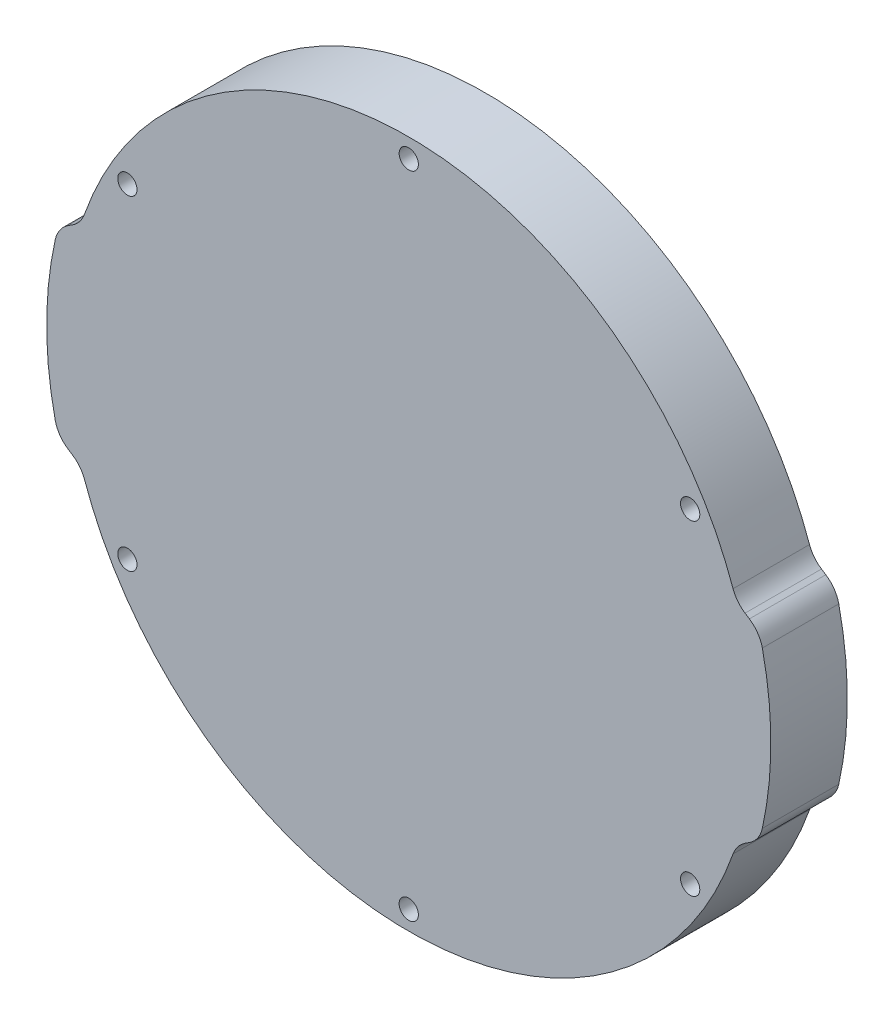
from build123d import *

# Parameters (mm, degrees)
SKETCH1_R           = 1.6
BOSS_EXTRUDE1_DEPTH = 12.7
FILLET1_R           = 5


with BuildPart() as part:
    # Sketch1 → Boss-Extrude1 (new body)
    with BuildSketch(Plane.XY):
        with BuildLine():
            Line((-58.249656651, 15), (-54.404710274, 17.5))
            ThreePointArc((-54.404710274, 17.5), (0, 57.15), (54.404710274, 17.5))
            Line((54.404710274, 17.5), (58.249656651, 15))
            ThreePointArc((58.249656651, 15), (60.15, 0), (58.249656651, -15))
            Line((58.249656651, -15), (54.404710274, -17.5))
            ThreePointArc((54.404710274, -17.5), (0, -57.15), (-54.404710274, -17.5))
            Line((-54.404710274, -17.5), (-58.249656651, -15))
            ThreePointArc((-58.249656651, -15), (-60.15, 0), (-58.249656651, 15))
        make_face()
        with Locations((0, 53.975)):
            Circle(SKETCH1_R, mode=Mode.SUBTRACT)
        with Locations((46.743721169, 26.9875)):
            Circle(SKETCH1_R, mode=Mode.SUBTRACT)
        with Locations((46.743721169, -26.9875)):
            Circle(SKETCH1_R, mode=Mode.SUBTRACT)
        with Locations((0, -53.975)):
            Circle(SKETCH1_R, mode=Mode.SUBTRACT)
        with Locations((-46.743721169, -26.9875)):
            Circle(SKETCH1_R, mode=Mode.SUBTRACT)
        with Locations((-46.743721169, 26.9875)):
            Circle(SKETCH1_R, mode=Mode.SUBTRACT)
    extrude(amount=BOSS_EXTRUDE1_DEPTH)

    # Fillet1
    fillet1_edges = [part.edges().sort_by_distance(p)[0] for p in [
        (58.249656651, -15, 6.35),
        (54.404710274, -17.5, 6.35),
        (-54.404710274, -17.5, 6.35),
        (-58.249656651, -15, 6.35),
        (-58.249656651, 15, 6.35),
        (-54.404710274, 17.5, 6.35),
        (54.404710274, 17.5, 6.35),
        (58.249656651, 15, 6.35),
    ]]
    fillet(fillet1_edges, radius=FILLET1_R)


solid = part.part
